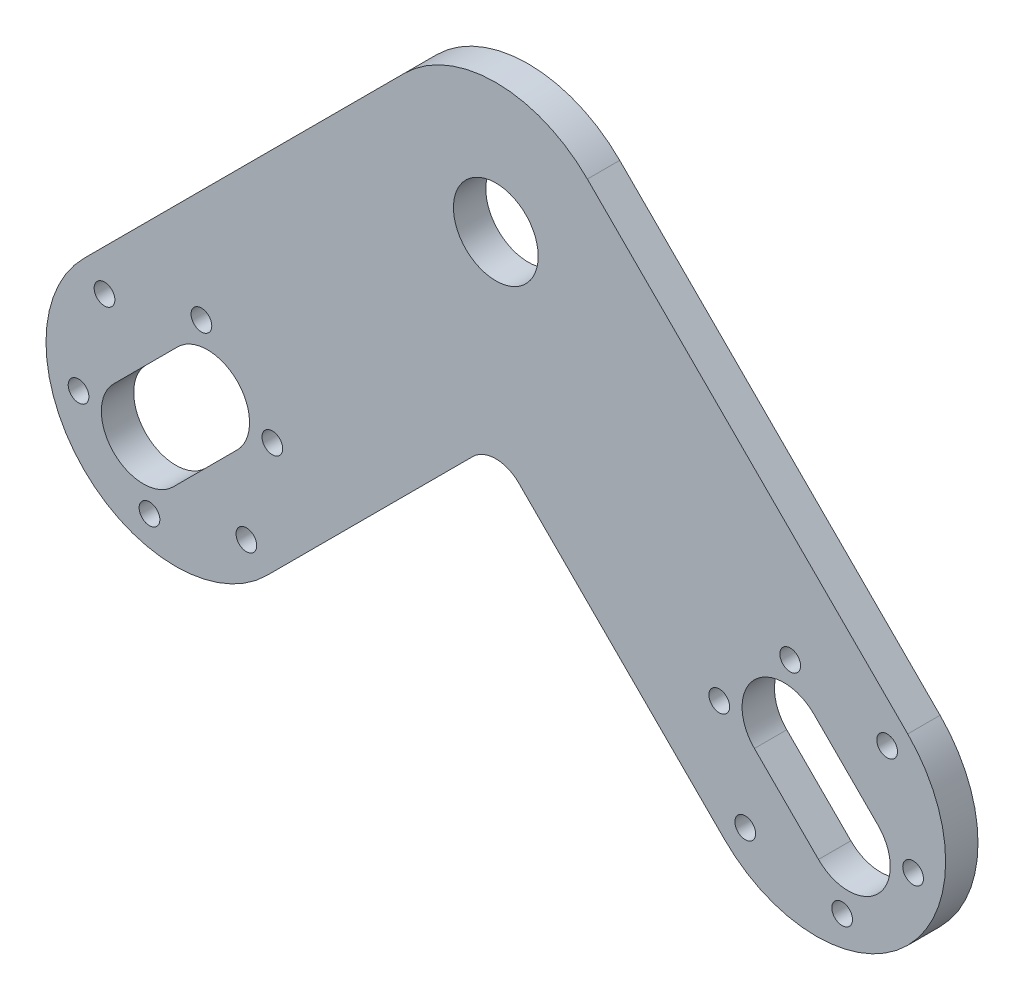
ISO-10303-21;
HEADER;
FILE_DESCRIPTION(('STEP AP214'),'2;1');
FILE_NAME('part.step','',(''),(''),'','','');
FILE_SCHEMA(('AUTOMOTIVE_DESIGN { 1 0 10303 214 1 1 1 1 }'));
ENDSEC;
DATA;
#1=APPLICATION_CONTEXT('core data for automotive mechanical design processes');
#2=APPLICATION_PROTOCOL_DEFINITION('international standard','automotive_design',2000,#1);
#3=PRODUCT_CONTEXT('',#1,'mechanical');
#4=PRODUCT('Part','Part','',(#3));
#5=PRODUCT_RELATED_PRODUCT_CATEGORY('part','',(#4));
#6=PRODUCT_DEFINITION_FORMATION('','',#4);
#7=PRODUCT_DEFINITION_CONTEXT('part definition',#1,'design');
#8=PRODUCT_DEFINITION('design','',#6,#7);
#9=PRODUCT_DEFINITION_SHAPE('','',#8);
#10=(LENGTH_UNIT() NAMED_UNIT(*) SI_UNIT(.MILLI.,.METRE.));
#11=(NAMED_UNIT(*) PLANE_ANGLE_UNIT() SI_UNIT($,.RADIAN.));
#12=(NAMED_UNIT(*) SI_UNIT($,.STERADIAN.) SOLID_ANGLE_UNIT());
#13=UNCERTAINTY_MEASURE_WITH_UNIT(LENGTH_MEASURE(1.E-05),#10,'distance_accuracy_value','');
#14=(GEOMETRIC_REPRESENTATION_CONTEXT(3) GLOBAL_UNCERTAINTY_ASSIGNED_CONTEXT((#13)) GLOBAL_UNIT_ASSIGNED_CONTEXT((#10,
#11,#12)) REPRESENTATION_CONTEXT('',''));
#15=CARTESIAN_POINT('',(0.,0.,0.));
#16=DIRECTION('',(0.,0.,1.));
#17=DIRECTION('',(1.,0.,0.));
#18=AXIS2_PLACEMENT_3D('',#15,#16,#17);
#19=CARTESIAN_POINT('',(0.,0.,5.));
#20=DIRECTION('',(0.,0.,1.));
#21=DIRECTION('',(1.,0.,0.));
#22=AXIS2_PLACEMENT_3D('',#19,#20,#21);
#23=PLANE('',#22);
#24=CARTESIAN_POINT('',(49.4974746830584,49.4974746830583,5.));
#25=DIRECTION('',(0.,0.,1.));
#26=DIRECTION('',(1.,0.,0.));
#27=AXIS2_PLACEMENT_3D('',#24,#25,#26);
#28=CIRCLE('',#27,6.55);
#29=CARTESIAN_POINT('',(56.0474746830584,49.4974746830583,5.));
#30=VERTEX_POINT('',#29);
#31=EDGE_CURVE('E574',#30,#30,#28,.T.);
#32=ORIENTED_EDGE('',*,*,#31,.F.);
#33=EDGE_LOOP('',(#32));
#34=FACE_BOUND('',#33,.T.);
#35=DIRECTION('',(-0.707106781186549,-0.707106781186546,0.));
#36=VECTOR('',#35,1.);
#37=CARTESIAN_POINT('',(-4.59619407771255,4.59619407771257,5.));
#38=LINE('',#37,#36);
#39=CARTESIAN_POINT('',(0.353553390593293,9.5459415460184,5.));
#40=VERTEX_POINT('',#39);
#41=CARTESIAN_POINT('',(-9.54594154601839,-0.353553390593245,5.));
#42=VERTEX_POINT('',#41);
#43=EDGE_CURVE('E356',#40,#42,#38,.T.);
#44=ORIENTED_EDGE('',*,*,#43,.F.);
#45=CARTESIAN_POINT('',(4.94974746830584,4.94974746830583,5.));
#46=DIRECTION('',(0.,0.,1.));
#47=DIRECTION('',(1.,0.,0.));
#48=AXIS2_PLACEMENT_3D('',#45,#46,#47);
#49=CIRCLE('',#48,6.5);
#50=CARTESIAN_POINT('',(9.54594154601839,0.353553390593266,5.));
#51=VERTEX_POINT('',#50);
#52=EDGE_CURVE('E351',#51,#40,#49,.T.);
#53=ORIENTED_EDGE('',*,*,#52,.F.);
#54=DIRECTION('',(0.707106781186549,0.707106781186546,0.));
#55=VECTOR('',#54,1.);
#56=CARTESIAN_POINT('',(4.59619407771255,-4.59619407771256,5.));
#57=LINE('',#56,#55);
#58=CARTESIAN_POINT('',(-0.353553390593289,-9.54594154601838,5.));
#59=VERTEX_POINT('',#58);
#60=EDGE_CURVE('E244',#59,#51,#57,.T.);
#61=ORIENTED_EDGE('',*,*,#60,.F.);
#62=CARTESIAN_POINT('',(-4.94974746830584,-4.94974746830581,5.));
#63=DIRECTION('',(0.,0.,1.));
#64=DIRECTION('',(1.,0.,0.));
#65=AXIS2_PLACEMENT_3D('',#62,#63,#64);
#66=CIRCLE('',#65,6.5);
#67=EDGE_CURVE('E358',#42,#59,#66,.T.);
#68=ORIENTED_EDGE('',*,*,#67,.F.);
#69=EDGE_LOOP('',(#44,#53,#61,#68));
#70=FACE_BOUND('',#69,.T.);
#71=CARTESIAN_POINT('',(14.9718503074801,4.01169519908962,5.));
#72=DIRECTION('',(0.,0.,1.));
#73=DIRECTION('',(1.,0.,0.));
#74=AXIS2_PLACEMENT_3D('',#71,#72,#73);
#75=CIRCLE('',#74,1.6);
#76=CARTESIAN_POINT('',(16.5718503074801,4.01169519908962,5.));
#77=VERTEX_POINT('',#76);
#78=EDGE_CURVE('E346',#77,#77,#75,.T.);
#79=ORIENTED_EDGE('',*,*,#78,.F.);
#80=EDGE_LOOP('',(#79));
#81=FACE_BOUND('',#80,.T.);
#82=CARTESIAN_POINT('',(88.0347942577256,-10.9601551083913,5.));
#83=DIRECTION('',(0.,0.,1.));
#84=DIRECTION('',(1.,0.,0.));
#85=AXIS2_PLACEMENT_3D('',#82,#83,#84);
#86=CIRCLE('',#85,1.6);
#87=CARTESIAN_POINT('',(89.6347942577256,-10.9601551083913,5.));
#88=VERTEX_POINT('',#87);
#89=EDGE_CURVE('E345',#88,#88,#86,.F.);
#90=ORIENTED_EDGE('',*,*,#89,.T.);
#91=EDGE_LOOP('',(#90));
#92=FACE_BOUND('',#91,.T.);
#93=CARTESIAN_POINT('',(113.966799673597,-4.01169519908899,5.));
#94=DIRECTION('',(0.,0.,1.));
#95=DIRECTION('',(1.,0.,0.));
#96=AXIS2_PLACEMENT_3D('',#93,#94,#95);
#97=CIRCLE('',#96,1.6);
#98=CARTESIAN_POINT('',(115.566799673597,-4.01169519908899,5.));
#99=VERTEX_POINT('',#98);
#100=EDGE_CURVE('E336',#99,#99,#97,.F.);
#101=ORIENTED_EDGE('',*,*,#100,.T.);
#102=EDGE_LOOP('',(#101));
#103=FACE_BOUND('',#102,.T.);
#104=CARTESIAN_POINT('',(94.9832541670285,14.9718503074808,5.));
#105=DIRECTION('',(0.,0.,1.));
#106=DIRECTION('',(1.,0.,0.));
#107=AXIS2_PLACEMENT_3D('',#104,#105,#106);
#108=CIRCLE('',#107,1.6);
#109=CARTESIAN_POINT('',(96.5832541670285,14.9718503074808,5.));
#110=VERTEX_POINT('',#109);
#111=EDGE_CURVE('E334',#110,#110,#108,.F.);
#112=ORIENTED_EDGE('',*,*,#111,.T.);
#113=EDGE_LOOP('',(#112));
#114=FACE_BOUND('',#113,.T.);
#115=CARTESIAN_POINT('',(4.01169519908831,14.9718503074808,5.));
#116=DIRECTION('',(0.,0.,1.));
#117=DIRECTION('',(1.,0.,0.));
#118=AXIS2_PLACEMENT_3D('',#115,#116,#117);
#119=CIRCLE('',#118,1.6);
#120=CARTESIAN_POINT('',(5.61169519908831,14.9718503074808,5.));
#121=VERTEX_POINT('',#120);
#122=EDGE_CURVE('E329',#121,#121,#119,.T.);
#123=ORIENTED_EDGE('',*,*,#122,.F.);
#124=EDGE_LOOP('',(#123));
#125=FACE_BOUND('',#124,.T.);
#126=CARTESIAN_POINT('',(-10.9601551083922,10.9601551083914,5.));
#127=DIRECTION('',(0.,0.,1.));
#128=DIRECTION('',(1.,0.,0.));
#129=AXIS2_PLACEMENT_3D('',#126,#127,#128);
#130=CIRCLE('',#129,1.6);
#131=CARTESIAN_POINT('',(-9.36015510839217,10.9601551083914,5.));
#132=VERTEX_POINT('',#131);
#133=EDGE_CURVE('E327',#132,#132,#130,.T.);
#134=ORIENTED_EDGE('',*,*,#133,.F.);
#135=EDGE_LOOP('',(#134));
#136=FACE_BOUND('',#135,.T.);
#137=CARTESIAN_POINT('',(-14.9718503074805,-4.01169519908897,5.));
#138=DIRECTION('',(0.,0.,1.));
#139=DIRECTION('',(1.,0.,0.));
#140=AXIS2_PLACEMENT_3D('',#137,#138,#139);
#141=CIRCLE('',#140,1.6);
#142=CARTESIAN_POINT('',(-13.3718503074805,-4.01169519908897,5.));
#143=VERTEX_POINT('',#142);
#144=EDGE_CURVE('E322',#143,#143,#141,.T.);
#145=ORIENTED_EDGE('',*,*,#144,.F.);
#146=EDGE_LOOP('',(#145));
#147=FACE_BOUND('',#146,.T.);
#148=CARTESIAN_POINT('',(-4.01169519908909,-14.9718503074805,5.));
#149=DIRECTION('',(0.,0.,1.));
#150=DIRECTION('',(1.,0.,0.));
#151=AXIS2_PLACEMENT_3D('',#148,#149,#150);
#152=CIRCLE('',#151,1.6);
#153=CARTESIAN_POINT('',(-2.4116951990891,-14.9718503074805,5.));
#154=VERTEX_POINT('',#153);
#155=EDGE_CURVE('E318',#154,#154,#152,.T.);
#156=ORIENTED_EDGE('',*,*,#155,.F.);
#157=EDGE_LOOP('',(#156));
#158=FACE_BOUND('',#157,.T.);
#159=CARTESIAN_POINT('',(10.9601551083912,-10.9601551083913,5.));
#160=DIRECTION('',(0.,0.,1.));
#161=DIRECTION('',(1.,0.,0.));
#162=AXIS2_PLACEMENT_3D('',#159,#160,#161);
#163=CIRCLE('',#162,1.59999999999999);
#164=CARTESIAN_POINT('',(12.5601551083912,-10.9601551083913,5.));
#165=VERTEX_POINT('',#164);
#166=EDGE_CURVE('E320',#165,#165,#163,.T.);
#167=ORIENTED_EDGE('',*,*,#166,.F.);
#168=EDGE_LOOP('',(#167));
#169=FACE_BOUND('',#168,.T.);
#170=DIRECTION('',(-0.707106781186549,0.707106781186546,0.));
#171=VECTOR('',#170,1.);
#172=CARTESIAN_POINT('',(63.6396103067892,63.6396103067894,5.));
#173=LINE('',#172,#171);
#174=CARTESIAN_POINT('',(113.137084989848,14.142135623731,5.));
#175=VERTEX_POINT('',#174);
#176=CARTESIAN_POINT('',(63.6396103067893,63.6396103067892,5.));
#177=VERTEX_POINT('',#176);
#178=EDGE_CURVE('E363',#175,#177,#173,.T.);
#179=ORIENTED_EDGE('',*,*,#178,.T.);
#180=CARTESIAN_POINT('',(49.4974746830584,49.4974746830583,5.));
#181=DIRECTION('',(0.,0.,1.));
#182=DIRECTION('',(1.,0.,0.));
#183=AXIS2_PLACEMENT_3D('',#180,#181,#182);
#184=CIRCLE('',#183,20.);
#185=CARTESIAN_POINT('',(35.3553390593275,63.6396103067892,5.));
#186=VERTEX_POINT('',#185);
#187=EDGE_CURVE('E364',#177,#186,#184,.T.);
#188=ORIENTED_EDGE('',*,*,#187,.T.);
#189=DIRECTION('',(0.707106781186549,0.707106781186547,0.));
#190=VECTOR('',#189,1.);
#191=CARTESIAN_POINT('',(-14.1421356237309,14.142135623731,5.));
#192=LINE('',#191,#190);
#193=CARTESIAN_POINT('',(-14.1421356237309,14.142135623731,5.));
#194=VERTEX_POINT('',#193);
#195=EDGE_CURVE('E370',#194,#186,#192,.T.);
#196=ORIENTED_EDGE('',*,*,#195,.F.);
#197=CARTESIAN_POINT('',(0.,0.,5.));
#198=DIRECTION('',(0.,0.,1.));
#199=DIRECTION('',(1.,0.,0.));
#200=AXIS2_PLACEMENT_3D('',#197,#198,#199);
#201=CIRCLE('',#200,20.);
#202=CARTESIAN_POINT('',(14.1421356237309,-14.142135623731,5.));
#203=VERTEX_POINT('',#202);
#204=EDGE_CURVE('E369',#194,#203,#201,.T.);
#205=ORIENTED_EDGE('',*,*,#204,.T.);
#206=DIRECTION('',(0.707106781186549,0.707106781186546,0.));
#207=VECTOR('',#206,1.);
#208=CARTESIAN_POINT('',(14.1421356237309,-14.142135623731,5.));
#209=LINE('',#208,#207);
#210=CARTESIAN_POINT('',(45.9619407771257,17.6776695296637,5.));
#211=VERTEX_POINT('',#210);
#212=EDGE_CURVE('E375',#203,#211,#209,.T.);
#213=ORIENTED_EDGE('',*,*,#212,.T.);
#214=CARTESIAN_POINT('',(49.4974746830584,14.1421356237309,5.));
#215=DIRECTION('',(0.,0.,1.));
#216=DIRECTION('',(1.,0.,0.));
#217=AXIS2_PLACEMENT_3D('',#214,#215,#216);
#218=CIRCLE('',#217,5.);
#219=CARTESIAN_POINT('',(53.0330085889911,17.6776695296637,5.));
#220=VERTEX_POINT('',#219);
#221=EDGE_CURVE('E12',#211,#220,#218,.F.);
#222=ORIENTED_EDGE('',*,*,#221,.T.);
#223=DIRECTION('',(-0.707106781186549,0.707106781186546,0.));
#224=VECTOR('',#223,1.);
#225=CARTESIAN_POINT('',(35.3553390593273,35.3553390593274,5.));
#226=LINE('',#225,#224);
#227=CARTESIAN_POINT('',(84.8528137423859,-14.142135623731,5.));
#228=VERTEX_POINT('',#227);
#229=EDGE_CURVE('E374',#228,#220,#226,.T.);
#230=ORIENTED_EDGE('',*,*,#229,.F.);
#231=CARTESIAN_POINT('',(98.9949493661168,0.,5.));
#232=DIRECTION('',(0.,0.,-1.));
#233=DIRECTION('',(-1.,0.,0.));
#234=AXIS2_PLACEMENT_3D('',#231,#232,#233);
#235=CIRCLE('',#234,20.);
#236=EDGE_CURVE('E384',#175,#228,#235,.T.);
#237=ORIENTED_EDGE('',*,*,#236,.F.);
#238=EDGE_LOOP('',(#179,#188,#196,#205,#213,#222,#230,#237));
#239=FACE_BOUND('',#238,.T.);
#240=DIRECTION('',(0.707106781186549,-0.707106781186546,0.));
#241=VECTOR('',#240,1.);
#242=CARTESIAN_POINT('',(54.0936687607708,54.093668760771,5.));
#243=LINE('',#242,#241);
#244=CARTESIAN_POINT('',(98.6413959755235,9.54594154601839,5.));
#245=VERTEX_POINT('',#244);
#246=CARTESIAN_POINT('',(108.540890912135,-0.353553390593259,5.));
#247=VERTEX_POINT('',#246);
#248=EDGE_CURVE('E311',#245,#247,#243,.T.);
#249=ORIENTED_EDGE('',*,*,#248,.T.);
#250=CARTESIAN_POINT('',(103.944696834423,-4.94974746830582,5.));
#251=DIRECTION('',(0.,0.,1.));
#252=DIRECTION('',(1.,0.,0.));
#253=AXIS2_PLACEMENT_3D('',#250,#251,#252);
#254=CIRCLE('',#253,6.50000000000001);
#255=CARTESIAN_POINT('',(99.3485027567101,-9.54594154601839,5.));
#256=VERTEX_POINT('',#255);
#257=EDGE_CURVE('E313',#247,#256,#254,.F.);
#258=ORIENTED_EDGE('',*,*,#257,.T.);
#259=DIRECTION('',(-0.707106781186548,0.707106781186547,0.));
#260=VECTOR('',#259,1.);
#261=CARTESIAN_POINT('',(44.9012806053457,44.9012806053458,5.));
#262=LINE('',#261,#260);
#263=CARTESIAN_POINT('',(89.4490078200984,0.353553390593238,5.));
#264=VERTEX_POINT('',#263);
#265=EDGE_CURVE('E297',#256,#264,#262,.T.);
#266=ORIENTED_EDGE('',*,*,#265,.T.);
#267=CARTESIAN_POINT('',(94.045201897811,4.94974746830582,5.));
#268=DIRECTION('',(0.,0.,1.));
#269=DIRECTION('',(1.,0.,0.));
#270=AXIS2_PLACEMENT_3D('',#267,#268,#269);
#271=CIRCLE('',#270,6.5);
#272=EDGE_CURVE('E308',#264,#245,#271,.F.);
#273=ORIENTED_EDGE('',*,*,#272,.T.);
#274=EDGE_LOOP('',(#249,#258,#266,#273));
#275=FACE_BOUND('',#274,.T.);
#276=CARTESIAN_POINT('',(109.955104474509,10.9601551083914,5.));
#277=DIRECTION('',(0.,0.,1.));
#278=DIRECTION('',(1.,0.,0.));
#279=AXIS2_PLACEMENT_3D('',#276,#277,#278);
#280=CIRCLE('',#279,1.6);
#281=CARTESIAN_POINT('',(111.555104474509,10.9601551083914,5.));
#282=VERTEX_POINT('',#281);
#283=EDGE_CURVE('E333',#282,#282,#280,.F.);
#284=ORIENTED_EDGE('',*,*,#283,.T.);
#285=EDGE_LOOP('',(#284));
#286=FACE_BOUND('',#285,.T.);
#287=CARTESIAN_POINT('',(84.0230990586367,4.01169519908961,5.));
#288=DIRECTION('',(0.,0.,1.));
#289=DIRECTION('',(1.,0.,0.));
#290=AXIS2_PLACEMENT_3D('',#287,#288,#289);
#291=CIRCLE('',#290,1.6);
#292=CARTESIAN_POINT('',(85.6230990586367,4.01169519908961,5.));
#293=VERTEX_POINT('',#292);
#294=EDGE_CURVE('E343',#293,#293,#291,.F.);
#295=ORIENTED_EDGE('',*,*,#294,.T.);
#296=EDGE_LOOP('',(#295));
#297=FACE_BOUND('',#296,.T.);
#298=CARTESIAN_POINT('',(103.006644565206,-14.9718503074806,5.));
#299=DIRECTION('',(0.,0.,1.));
#300=DIRECTION('',(1.,0.,0.));
#301=AXIS2_PLACEMENT_3D('',#298,#299,#300);
#302=CIRCLE('',#301,1.6);
#303=CARTESIAN_POINT('',(104.606644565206,-14.9718503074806,5.));
#304=VERTEX_POINT('',#303);
#305=EDGE_CURVE('E350',#304,#304,#302,.F.);
#306=ORIENTED_EDGE('',*,*,#305,.T.);
#307=EDGE_LOOP('',(#306));
#308=FACE_BOUND('',#307,.T.);
#309=ADVANCED_FACE('F129',(#34,#70,#81,#92,#103,#114,#125,#136,#147,#158,#169,#239,#275,#286,
#297,#308),#23,.T.);
#310=CARTESIAN_POINT('',(0.,0.,0.));
#311=DIRECTION('',(0.,0.,1.));
#312=DIRECTION('',(1.,0.,0.));
#313=AXIS2_PLACEMENT_3D('',#310,#311,#312);
#314=PLANE('',#313);
#315=CARTESIAN_POINT('',(49.4974746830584,49.4974746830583,0.));
#316=DIRECTION('',(0.,0.,1.));
#317=DIRECTION('',(1.,0.,0.));
#318=AXIS2_PLACEMENT_3D('',#315,#316,#317);
#319=CIRCLE('',#318,6.55);
#320=CARTESIAN_POINT('',(56.0474746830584,49.4974746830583,0.));
#321=VERTEX_POINT('',#320);
#322=EDGE_CURVE('E132',#321,#321,#319,.T.);
#323=ORIENTED_EDGE('',*,*,#322,.T.);
#324=EDGE_LOOP('',(#323));
#325=FACE_BOUND('',#324,.T.);
#326=CARTESIAN_POINT('',(4.94974746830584,4.94974746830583,0.));
#327=DIRECTION('',(0.,0.,-1.));
#328=DIRECTION('',(-1.,0.,0.));
#329=AXIS2_PLACEMENT_3D('',#326,#327,#328);
#330=CIRCLE('',#329,6.5);
#331=CARTESIAN_POINT('',(0.353553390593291,9.5459415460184,0.));
#332=VERTEX_POINT('',#331);
#333=CARTESIAN_POINT('',(9.54594154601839,0.353553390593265,0.));
#334=VERTEX_POINT('',#333);
#335=EDGE_CURVE('E255',#332,#334,#330,.T.);
#336=ORIENTED_EDGE('',*,*,#335,.F.);
#337=DIRECTION('',(0.707106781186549,0.707106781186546,0.));
#338=VECTOR('',#337,1.);
#339=CARTESIAN_POINT('',(-4.59619407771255,4.59619407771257,0.));
#340=LINE('',#339,#338);
#341=CARTESIAN_POINT('',(-9.54594154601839,-0.353553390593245,0.));
#342=VERTEX_POINT('',#341);
#343=EDGE_CURVE('E259',#342,#332,#340,.T.);
#344=ORIENTED_EDGE('',*,*,#343,.F.);
#345=CARTESIAN_POINT('',(-4.94974746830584,-4.94974746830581,0.));
#346=DIRECTION('',(0.,0.,-1.));
#347=DIRECTION('',(-1.,0.,0.));
#348=AXIS2_PLACEMENT_3D('',#345,#346,#347);
#349=CIRCLE('',#348,6.5);
#350=CARTESIAN_POINT('',(-0.353553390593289,-9.54594154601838,0.));
#351=VERTEX_POINT('',#350);
#352=EDGE_CURVE('E265',#351,#342,#349,.T.);
#353=ORIENTED_EDGE('',*,*,#352,.F.);
#354=DIRECTION('',(-0.707106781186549,-0.707106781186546,0.));
#355=VECTOR('',#354,1.);
#356=CARTESIAN_POINT('',(4.59619407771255,-4.59619407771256,0.));
#357=LINE('',#356,#355);
#358=EDGE_CURVE('E245',#334,#351,#357,.T.);
#359=ORIENTED_EDGE('',*,*,#358,.F.);
#360=EDGE_LOOP('',(#336,#344,#353,#359));
#361=FACE_BOUND('',#360,.T.);
#362=CARTESIAN_POINT('',(14.9718503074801,4.01169519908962,0.));
#363=DIRECTION('',(0.,0.,-1.));
#364=DIRECTION('',(-1.,0.,0.));
#365=AXIS2_PLACEMENT_3D('',#362,#363,#364);
#366=CIRCLE('',#365,1.6);
#367=CARTESIAN_POINT('',(13.3718503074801,4.01169519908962,0.));
#368=VERTEX_POINT('',#367);
#369=EDGE_CURVE('E266',#368,#368,#366,.T.);
#370=ORIENTED_EDGE('',*,*,#369,.F.);
#371=EDGE_LOOP('',(#370));
#372=FACE_BOUND('',#371,.T.);
#373=CARTESIAN_POINT('',(4.01169519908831,14.9718503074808,0.));
#374=DIRECTION('',(0.,0.,-1.));
#375=DIRECTION('',(-1.,0.,0.));
#376=AXIS2_PLACEMENT_3D('',#373,#374,#375);
#377=CIRCLE('',#376,1.6);
#378=CARTESIAN_POINT('',(2.41169519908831,14.9718503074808,0.));
#379=VERTEX_POINT('',#378);
#380=EDGE_CURVE('E585',#379,#379,#377,.T.);
#381=ORIENTED_EDGE('',*,*,#380,.F.);
#382=EDGE_LOOP('',(#381));
#383=FACE_BOUND('',#382,.T.);
#384=CARTESIAN_POINT('',(-10.9601551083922,10.9601551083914,0.));
#385=DIRECTION('',(0.,0.,-1.));
#386=DIRECTION('',(-1.,0.,0.));
#387=AXIS2_PLACEMENT_3D('',#384,#385,#386);
#388=CIRCLE('',#387,1.6);
#389=CARTESIAN_POINT('',(-12.5601551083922,10.9601551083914,0.));
#390=VERTEX_POINT('',#389);
#391=EDGE_CURVE('E590',#390,#390,#388,.T.);
#392=ORIENTED_EDGE('',*,*,#391,.F.);
#393=EDGE_LOOP('',(#392));
#394=FACE_BOUND('',#393,.T.);
#395=CARTESIAN_POINT('',(-14.9718503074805,-4.01169519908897,0.));
#396=DIRECTION('',(0.,0.,-1.));
#397=DIRECTION('',(-1.,0.,0.));
#398=AXIS2_PLACEMENT_3D('',#395,#396,#397);
#399=CIRCLE('',#398,1.6);
#400=CARTESIAN_POINT('',(-16.5718503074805,-4.01169519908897,0.));
#401=VERTEX_POINT('',#400);
#402=EDGE_CURVE('E586',#401,#401,#399,.T.);
#403=ORIENTED_EDGE('',*,*,#402,.F.);
#404=EDGE_LOOP('',(#403));
#405=FACE_BOUND('',#404,.T.);
#406=CARTESIAN_POINT('',(-4.01169519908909,-14.9718503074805,0.));
#407=DIRECTION('',(0.,0.,-1.));
#408=DIRECTION('',(-1.,0.,0.));
#409=AXIS2_PLACEMENT_3D('',#406,#407,#408);
#410=CIRCLE('',#409,1.6);
#411=CARTESIAN_POINT('',(-5.61169519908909,-14.9718503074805,0.));
#412=VERTEX_POINT('',#411);
#413=EDGE_CURVE('E578',#412,#412,#410,.T.);
#414=ORIENTED_EDGE('',*,*,#413,.F.);
#415=EDGE_LOOP('',(#414));
#416=FACE_BOUND('',#415,.T.);
#417=CARTESIAN_POINT('',(10.9601551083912,-10.9601551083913,0.));
#418=DIRECTION('',(0.,0.,-1.));
#419=DIRECTION('',(-1.,0.,0.));
#420=AXIS2_PLACEMENT_3D('',#417,#418,#419);
#421=CIRCLE('',#420,1.59999999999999);
#422=CARTESIAN_POINT('',(9.36015510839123,-10.9601551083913,0.));
#423=VERTEX_POINT('',#422);
#424=EDGE_CURVE('E579',#423,#423,#421,.T.);
#425=ORIENTED_EDGE('',*,*,#424,.F.);
#426=EDGE_LOOP('',(#425));
#427=FACE_BOUND('',#426,.T.);
#428=DIRECTION('',(-0.707106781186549,0.707106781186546,0.));
#429=VECTOR('',#428,1.);
#430=CARTESIAN_POINT('',(63.6396103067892,63.6396103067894,0.));
#431=LINE('',#430,#429);
#432=CARTESIAN_POINT('',(113.137084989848,14.142135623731,0.));
#433=VERTEX_POINT('',#432);
#434=CARTESIAN_POINT('',(63.6396103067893,63.6396103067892,0.));
#435=VERTEX_POINT('',#434);
#436=EDGE_CURVE('E378',#433,#435,#431,.T.);
#437=ORIENTED_EDGE('',*,*,#436,.F.);
#438=CARTESIAN_POINT('',(98.9949493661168,0.,0.));
#439=DIRECTION('',(0.,0.,-1.));
#440=DIRECTION('',(-1.,0.,0.));
#441=AXIS2_PLACEMENT_3D('',#438,#439,#440);
#442=CIRCLE('',#441,20.);
#443=CARTESIAN_POINT('',(84.8528137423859,-14.142135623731,0.));
#444=VERTEX_POINT('',#443);
#445=EDGE_CURVE('E359',#433,#444,#442,.T.);
#446=ORIENTED_EDGE('',*,*,#445,.T.);
#447=DIRECTION('',(-0.707106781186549,0.707106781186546,0.));
#448=VECTOR('',#447,1.);
#449=CARTESIAN_POINT('',(35.3553390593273,35.3553390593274,0.));
#450=LINE('',#449,#448);
#451=CARTESIAN_POINT('',(53.0330085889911,17.6776695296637,0.));
#452=VERTEX_POINT('',#451);
#453=EDGE_CURVE('E362',#444,#452,#450,.T.);
#454=ORIENTED_EDGE('',*,*,#453,.T.);
#455=CARTESIAN_POINT('',(49.4974746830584,14.1421356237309,0.));
#456=DIRECTION('',(0.,0.,1.));
#457=DIRECTION('',(1.,0.,0.));
#458=AXIS2_PLACEMENT_3D('',#455,#456,#457);
#459=CIRCLE('',#458,5.);
#460=CARTESIAN_POINT('',(45.9619407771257,17.6776695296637,0.));
#461=VERTEX_POINT('',#460);
#462=EDGE_CURVE('E137',#452,#461,#459,.T.);
#463=ORIENTED_EDGE('',*,*,#462,.T.);
#464=DIRECTION('',(0.707106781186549,0.707106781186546,0.));
#465=VECTOR('',#464,1.);
#466=CARTESIAN_POINT('',(14.1421356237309,-14.142135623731,0.));
#467=LINE('',#466,#465);
#468=CARTESIAN_POINT('',(14.1421356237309,-14.142135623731,0.));
#469=VERTEX_POINT('',#468);
#470=EDGE_CURVE('E392',#469,#461,#467,.T.);
#471=ORIENTED_EDGE('',*,*,#470,.F.);
#472=CARTESIAN_POINT('',(0.,0.,0.));
#473=DIRECTION('',(0.,0.,1.));
#474=DIRECTION('',(1.,0.,0.));
#475=AXIS2_PLACEMENT_3D('',#472,#473,#474);
#476=CIRCLE('',#475,20.);
#477=CARTESIAN_POINT('',(-14.1421356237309,14.142135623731,0.));
#478=VERTEX_POINT('',#477);
#479=EDGE_CURVE('E390',#478,#469,#476,.T.);
#480=ORIENTED_EDGE('',*,*,#479,.F.);
#481=DIRECTION('',(0.707106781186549,0.707106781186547,0.));
#482=VECTOR('',#481,1.);
#483=CARTESIAN_POINT('',(-14.1421356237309,14.142135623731,0.));
#484=LINE('',#483,#482);
#485=CARTESIAN_POINT('',(35.3553390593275,63.6396103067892,0.));
#486=VERTEX_POINT('',#485);
#487=EDGE_CURVE('E388',#478,#486,#484,.T.);
#488=ORIENTED_EDGE('',*,*,#487,.T.);
#489=CARTESIAN_POINT('',(49.4974746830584,49.4974746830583,0.));
#490=DIRECTION('',(0.,0.,1.));
#491=DIRECTION('',(1.,0.,0.));
#492=AXIS2_PLACEMENT_3D('',#489,#490,#491);
#493=CIRCLE('',#492,20.);
#494=EDGE_CURVE('E385',#435,#486,#493,.T.);
#495=ORIENTED_EDGE('',*,*,#494,.F.);
#496=EDGE_LOOP('',(#437,#446,#454,#463,#471,#480,#488,#495));
#497=FACE_BOUND('',#496,.T.);
#498=CARTESIAN_POINT('',(103.944696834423,-4.94974746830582,0.));
#499=DIRECTION('',(0.,0.,-1.));
#500=DIRECTION('',(-1.,0.,0.));
#501=AXIS2_PLACEMENT_3D('',#498,#499,#500);
#502=CIRCLE('',#501,6.50000000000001);
#503=CARTESIAN_POINT('',(99.3485027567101,-9.54594154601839,0.));
#504=VERTEX_POINT('',#503);
#505=CARTESIAN_POINT('',(108.540890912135,-0.353553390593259,0.));
#506=VERTEX_POINT('',#505);
#507=EDGE_CURVE('E273',#504,#506,#502,.F.);
#508=ORIENTED_EDGE('',*,*,#507,.T.);
#509=DIRECTION('',(-0.707106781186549,0.707106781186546,0.));
#510=VECTOR('',#509,1.);
#511=CARTESIAN_POINT('',(54.0936687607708,54.093668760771,0.));
#512=LINE('',#511,#510);
#513=CARTESIAN_POINT('',(98.6413959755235,9.54594154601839,0.));
#514=VERTEX_POINT('',#513);
#515=EDGE_CURVE('E295',#506,#514,#512,.T.);
#516=ORIENTED_EDGE('',*,*,#515,.T.);
#517=CARTESIAN_POINT('',(94.045201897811,4.94974746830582,0.));
#518=DIRECTION('',(0.,0.,-1.));
#519=DIRECTION('',(-1.,0.,0.));
#520=AXIS2_PLACEMENT_3D('',#517,#518,#519);
#521=CIRCLE('',#520,6.5);
#522=CARTESIAN_POINT('',(89.4490078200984,0.353553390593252,0.));
#523=VERTEX_POINT('',#522);
#524=EDGE_CURVE('E293',#514,#523,#521,.F.);
#525=ORIENTED_EDGE('',*,*,#524,.T.);
#526=DIRECTION('',(0.707106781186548,-0.707106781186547,0.));
#527=VECTOR('',#526,1.);
#528=CARTESIAN_POINT('',(44.9012806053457,44.9012806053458,0.));
#529=LINE('',#528,#527);
#530=EDGE_CURVE('E286',#523,#504,#529,.T.);
#531=ORIENTED_EDGE('',*,*,#530,.T.);
#532=EDGE_LOOP('',(#508,#516,#525,#531));
#533=FACE_BOUND('',#532,.T.);
#534=CARTESIAN_POINT('',(94.9832541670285,14.9718503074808,0.));
#535=DIRECTION('',(0.,0.,-1.));
#536=DIRECTION('',(-1.,0.,0.));
#537=AXIS2_PLACEMENT_3D('',#534,#535,#536);
#538=CIRCLE('',#537,1.6);
#539=CARTESIAN_POINT('',(93.3832541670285,14.9718503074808,0.));
#540=VERTEX_POINT('',#539);
#541=EDGE_CURVE('E275',#540,#540,#538,.F.);
#542=ORIENTED_EDGE('',*,*,#541,.T.);
#543=EDGE_LOOP('',(#542));
#544=FACE_BOUND('',#543,.T.);
#545=CARTESIAN_POINT('',(109.955104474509,10.9601551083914,0.));
#546=DIRECTION('',(0.,0.,-1.));
#547=DIRECTION('',(-1.,0.,0.));
#548=AXIS2_PLACEMENT_3D('',#545,#546,#547);
#549=CIRCLE('',#548,1.6);
#550=CARTESIAN_POINT('',(108.355104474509,10.9601551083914,0.));
#551=VERTEX_POINT('',#550);
#552=EDGE_CURVE('E278',#551,#551,#549,.F.);
#553=ORIENTED_EDGE('',*,*,#552,.T.);
#554=EDGE_LOOP('',(#553));
#555=FACE_BOUND('',#554,.T.);
#556=CARTESIAN_POINT('',(113.966799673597,-4.01169519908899,0.));
#557=DIRECTION('',(0.,0.,-1.));
#558=DIRECTION('',(-1.,0.,0.));
#559=AXIS2_PLACEMENT_3D('',#556,#557,#558);
#560=CIRCLE('',#559,1.6);
#561=CARTESIAN_POINT('',(112.366799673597,-4.01169519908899,0.));
#562=VERTEX_POINT('',#561);
#563=EDGE_CURVE('E280',#562,#562,#560,.F.);
#564=ORIENTED_EDGE('',*,*,#563,.T.);
#565=EDGE_LOOP('',(#564));
#566=FACE_BOUND('',#565,.T.);
#567=CARTESIAN_POINT('',(84.0230990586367,4.01169519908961,0.));
#568=DIRECTION('',(0.,0.,-1.));
#569=DIRECTION('',(-1.,0.,0.));
#570=AXIS2_PLACEMENT_3D('',#567,#568,#569);
#571=CIRCLE('',#570,1.6);
#572=CARTESIAN_POINT('',(82.4230990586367,4.01169519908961,0.));
#573=VERTEX_POINT('',#572);
#574=EDGE_CURVE('E285',#573,#573,#571,.F.);
#575=ORIENTED_EDGE('',*,*,#574,.T.);
#576=EDGE_LOOP('',(#575));
#577=FACE_BOUND('',#576,.T.);
#578=CARTESIAN_POINT('',(88.0347942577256,-10.9601551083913,0.));
#579=DIRECTION('',(0.,0.,-1.));
#580=DIRECTION('',(-1.,0.,0.));
#581=AXIS2_PLACEMENT_3D('',#578,#579,#580);
#582=CIRCLE('',#581,1.6);
#583=CARTESIAN_POINT('',(86.4347942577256,-10.9601551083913,0.));
#584=VERTEX_POINT('',#583);
#585=EDGE_CURVE('E281',#584,#584,#582,.F.);
#586=ORIENTED_EDGE('',*,*,#585,.T.);
#587=EDGE_LOOP('',(#586));
#588=FACE_BOUND('',#587,.T.);
#589=CARTESIAN_POINT('',(103.006644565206,-14.9718503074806,0.));
#590=DIRECTION('',(0.,0.,-1.));
#591=DIRECTION('',(-1.,0.,0.));
#592=AXIS2_PLACEMENT_3D('',#589,#590,#591);
#593=CIRCLE('',#592,1.6);
#594=CARTESIAN_POINT('',(101.406644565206,-14.9718503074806,0.));
#595=VERTEX_POINT('',#594);
#596=EDGE_CURVE('E600',#595,#595,#593,.F.);
#597=ORIENTED_EDGE('',*,*,#596,.T.);
#598=EDGE_LOOP('',(#597));
#599=FACE_BOUND('',#598,.T.);
#600=ADVANCED_FACE('F260',(#325,#361,#372,#383,#394,#405,#416,#427,#497,#533,#544,#555,#566,
#577,#588,#599),#314,.F.);
#601=CARTESIAN_POINT('',(63.6396103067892,63.6396103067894,5.));
#602=DIRECTION('',(-0.707106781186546,-0.707106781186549,0.));
#603=DIRECTION('',(0.707106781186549,-0.707106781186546,0.));
#604=AXIS2_PLACEMENT_3D('',#601,#602,#603);
#605=PLANE('',#604);
#606=ORIENTED_EDGE('',*,*,#436,.T.);
#607=DIRECTION('',(0.,0.,-1.));
#608=VECTOR('',#607,1.);
#609=CARTESIAN_POINT('',(63.6396103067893,63.6396103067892,5.));
#610=LINE('',#609,#608);
#611=EDGE_CURVE('E408',#177,#435,#610,.T.);
#612=ORIENTED_EDGE('',*,*,#611,.F.);
#613=ORIENTED_EDGE('',*,*,#178,.F.);
#614=DIRECTION('',(0.,0.,-1.));
#615=VECTOR('',#614,1.);
#616=CARTESIAN_POINT('',(113.137084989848,14.142135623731,5.));
#617=LINE('',#616,#615);
#618=EDGE_CURVE('E377',#175,#433,#617,.T.);
#619=ORIENTED_EDGE('',*,*,#618,.T.);
#620=EDGE_LOOP('',(#606,#612,#613,#619));
#621=FACE_BOUND('',#620,.T.);
#622=ADVANCED_FACE('F443',(#621),#605,.F.);
#623=CARTESIAN_POINT('',(49.4974746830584,49.4974746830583,5.));
#624=DIRECTION('',(0.,0.,-1.));
#625=DIRECTION('',(-1.,0.,0.));
#626=AXIS2_PLACEMENT_3D('',#623,#624,#625);
#627=CYLINDRICAL_SURFACE('',#626,20.);
#628=ORIENTED_EDGE('',*,*,#494,.T.);
#629=DIRECTION('',(0.,0.,-1.));
#630=VECTOR('',#629,1.);
#631=CARTESIAN_POINT('',(35.3553390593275,63.6396103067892,5.));
#632=LINE('',#631,#630);
#633=EDGE_CURVE('E404',#186,#486,#632,.T.);
#634=ORIENTED_EDGE('',*,*,#633,.F.);
#635=ORIENTED_EDGE('',*,*,#187,.F.);
#636=ORIENTED_EDGE('',*,*,#611,.T.);
#637=EDGE_LOOP('',(#628,#634,#635,#636));
#638=FACE_BOUND('',#637,.T.);
#639=ADVANCED_FACE('F447',(#638),#627,.T.);
#640=CARTESIAN_POINT('',(-14.1421356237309,14.142135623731,5.));
#641=DIRECTION('',(-0.707106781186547,0.707106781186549,0.));
#642=DIRECTION('',(-0.707106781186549,-0.707106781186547,0.));
#643=AXIS2_PLACEMENT_3D('',#640,#641,#642);
#644=PLANE('',#643);
#645=ORIENTED_EDGE('',*,*,#487,.F.);
#646=DIRECTION('',(0.,0.,-1.));
#647=VECTOR('',#646,1.);
#648=CARTESIAN_POINT('',(-14.1421356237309,14.142135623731,5.));
#649=LINE('',#648,#647);
#650=EDGE_CURVE('E405',#194,#478,#649,.T.);
#651=ORIENTED_EDGE('',*,*,#650,.F.);
#652=ORIENTED_EDGE('',*,*,#195,.T.);
#653=ORIENTED_EDGE('',*,*,#633,.T.);
#654=EDGE_LOOP('',(#645,#651,#652,#653));
#655=FACE_BOUND('',#654,.T.);
#656=ADVANCED_FACE('F454',(#655),#644,.T.);
#657=CARTESIAN_POINT('',(0.,0.,5.));
#658=DIRECTION('',(0.,0.,-1.));
#659=DIRECTION('',(-1.,0.,0.));
#660=AXIS2_PLACEMENT_3D('',#657,#658,#659);
#661=CYLINDRICAL_SURFACE('',#660,20.);
#662=ORIENTED_EDGE('',*,*,#479,.T.);
#663=DIRECTION('',(0.,0.,-1.));
#664=VECTOR('',#663,1.);
#665=CARTESIAN_POINT('',(14.1421356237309,-14.142135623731,5.));
#666=LINE('',#665,#664);
#667=EDGE_CURVE('E396',#203,#469,#666,.T.);
#668=ORIENTED_EDGE('',*,*,#667,.F.);
#669=ORIENTED_EDGE('',*,*,#204,.F.);
#670=ORIENTED_EDGE('',*,*,#650,.T.);
#671=EDGE_LOOP('',(#662,#668,#669,#670));
#672=FACE_BOUND('',#671,.T.);
#673=ADVANCED_FACE('F455',(#672),#661,.T.);
#674=CARTESIAN_POINT('',(14.1421356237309,-14.142135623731,5.));
#675=DIRECTION('',(-0.707106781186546,0.707106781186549,0.));
#676=DIRECTION('',(-0.707106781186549,-0.707106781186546,0.));
#677=AXIS2_PLACEMENT_3D('',#674,#675,#676);
#678=PLANE('',#677);
#679=ORIENTED_EDGE('',*,*,#470,.T.);
#680=DIRECTION('',(0.,0.,-1.));
#681=VECTOR('',#680,1.);
#682=CARTESIAN_POINT('',(45.9619407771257,17.6776695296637,5.));
#683=LINE('',#682,#681);
#684=EDGE_CURVE('E418',#461,#211,#683,.F.);
#685=ORIENTED_EDGE('',*,*,#684,.T.);
#686=ORIENTED_EDGE('',*,*,#212,.F.);
#687=ORIENTED_EDGE('',*,*,#667,.T.);
#688=EDGE_LOOP('',(#679,#685,#686,#687));
#689=FACE_BOUND('',#688,.T.);
#690=ADVANCED_FACE('F426',(#689),#678,.F.);
#691=CARTESIAN_POINT('',(35.3553390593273,35.3553390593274,5.));
#692=DIRECTION('',(-0.707106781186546,-0.707106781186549,0.));
#693=DIRECTION('',(0.707106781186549,-0.707106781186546,0.));
#694=AXIS2_PLACEMENT_3D('',#691,#692,#693);
#695=PLANE('',#694);
#696=ORIENTED_EDGE('',*,*,#229,.T.);
#697=DIRECTION('',(0.,0.,-1.));
#698=VECTOR('',#697,1.);
#699=CARTESIAN_POINT('',(53.0330085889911,17.6776695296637,5.));
#700=LINE('',#699,#698);
#701=EDGE_CURVE('E410',#220,#452,#700,.T.);
#702=ORIENTED_EDGE('',*,*,#701,.T.);
#703=ORIENTED_EDGE('',*,*,#453,.F.);
#704=DIRECTION('',(0.,0.,-1.));
#705=VECTOR('',#704,1.);
#706=CARTESIAN_POINT('',(84.8528137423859,-14.142135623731,5.));
#707=LINE('',#706,#705);
#708=EDGE_CURVE('E399',#228,#444,#707,.T.);
#709=ORIENTED_EDGE('',*,*,#708,.F.);
#710=EDGE_LOOP('',(#696,#702,#703,#709));
#711=FACE_BOUND('',#710,.T.);
#712=ADVANCED_FACE('F440',(#711),#695,.T.);
#713=CARTESIAN_POINT('',(98.9949493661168,0.,5.));
#714=DIRECTION('',(0.,0.,-1.));
#715=DIRECTION('',(-1.,0.,0.));
#716=AXIS2_PLACEMENT_3D('',#713,#714,#715);
#717=CYLINDRICAL_SURFACE('',#716,20.);
#718=ORIENTED_EDGE('',*,*,#618,.F.);
#719=ORIENTED_EDGE('',*,*,#236,.T.);
#720=ORIENTED_EDGE('',*,*,#708,.T.);
#721=ORIENTED_EDGE('',*,*,#445,.F.);
#722=EDGE_LOOP('',(#718,#719,#720,#721));
#723=FACE_BOUND('',#722,.T.);
#724=ADVANCED_FACE('F439',(#723),#717,.T.);
#725=CARTESIAN_POINT('',(49.4974746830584,14.1421356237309,5.));
#726=DIRECTION('',(0.,0.,-1.));
#727=DIRECTION('',(-1.,0.,0.));
#728=AXIS2_PLACEMENT_3D('',#725,#726,#727);
#729=CYLINDRICAL_SURFACE('',#728,5.);
#730=ORIENTED_EDGE('',*,*,#221,.F.);
#731=ORIENTED_EDGE('',*,*,#684,.F.);
#732=ORIENTED_EDGE('',*,*,#462,.F.);
#733=ORIENTED_EDGE('',*,*,#701,.F.);
#734=EDGE_LOOP('',(#730,#731,#732,#733));
#735=FACE_BOUND('',#734,.T.);
#736=ADVANCED_FACE('F130',(#735),#729,.F.);
#737=CARTESIAN_POINT('',(103.944696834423,-4.94974746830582,10.));
#738=DIRECTION('',(0.,0.,-1.));
#739=DIRECTION('',(-1.,0.,0.));
#740=AXIS2_PLACEMENT_3D('',#737,#738,#739);
#741=CYLINDRICAL_SURFACE('',#740,6.50000000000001);
#742=DIRECTION('',(0.,0.,-1.));
#743=VECTOR('',#742,1.);
#744=CARTESIAN_POINT('',(108.540890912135,-0.353553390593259,10.));
#745=LINE('',#744,#743);
#746=EDGE_CURVE('E296',#247,#506,#745,.T.);
#747=ORIENTED_EDGE('',*,*,#746,.T.);
#748=ORIENTED_EDGE('',*,*,#507,.F.);
#749=DIRECTION('',(0.,0.,-1.));
#750=VECTOR('',#749,1.);
#751=CARTESIAN_POINT('',(99.3485027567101,-9.54594154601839,10.));
#752=LINE('',#751,#750);
#753=EDGE_CURVE('E300',#256,#504,#752,.T.);
#754=ORIENTED_EDGE('',*,*,#753,.F.);
#755=ORIENTED_EDGE('',*,*,#257,.F.);
#756=EDGE_LOOP('',(#747,#748,#754,#755));
#757=FACE_BOUND('',#756,.T.);
#758=ADVANCED_FACE('F477',(#757),#741,.F.);
#759=CARTESIAN_POINT('',(54.0936687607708,54.093668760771,10.));
#760=DIRECTION('',(-0.707106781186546,-0.707106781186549,0.));
#761=DIRECTION('',(0.707106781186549,-0.707106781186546,0.));
#762=AXIS2_PLACEMENT_3D('',#759,#760,#761);
#763=PLANE('',#762);
#764=DIRECTION('',(0.,0.,-1.));
#765=VECTOR('',#764,1.);
#766=CARTESIAN_POINT('',(98.6413959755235,9.54594154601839,10.));
#767=LINE('',#766,#765);
#768=EDGE_CURVE('E301',#245,#514,#767,.T.);
#769=ORIENTED_EDGE('',*,*,#768,.T.);
#770=ORIENTED_EDGE('',*,*,#515,.F.);
#771=ORIENTED_EDGE('',*,*,#746,.F.);
#772=ORIENTED_EDGE('',*,*,#248,.F.);
#773=EDGE_LOOP('',(#769,#770,#771,#772));
#774=FACE_BOUND('',#773,.T.);
#775=ADVANCED_FACE('F488',(#774),#763,.T.);
#776=CARTESIAN_POINT('',(94.045201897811,4.94974746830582,10.));
#777=DIRECTION('',(0.,0.,-1.));
#778=DIRECTION('',(-1.,0.,0.));
#779=AXIS2_PLACEMENT_3D('',#776,#777,#778);
#780=CYLINDRICAL_SURFACE('',#779,6.5);
#781=DIRECTION('',(0.,0.,-1.));
#782=VECTOR('',#781,1.);
#783=CARTESIAN_POINT('',(89.4490078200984,0.353553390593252,10.));
#784=LINE('',#783,#782);
#785=EDGE_CURVE('E152',#264,#523,#784,.T.);
#786=ORIENTED_EDGE('',*,*,#785,.T.);
#787=ORIENTED_EDGE('',*,*,#524,.F.);
#788=ORIENTED_EDGE('',*,*,#768,.F.);
#789=ORIENTED_EDGE('',*,*,#272,.F.);
#790=EDGE_LOOP('',(#786,#787,#788,#789));
#791=FACE_BOUND('',#790,.T.);
#792=ADVANCED_FACE('F493',(#791),#780,.F.);
#793=CARTESIAN_POINT('',(44.9012806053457,44.9012806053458,10.));
#794=DIRECTION('',(0.707106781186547,0.707106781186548,0.));
#795=DIRECTION('',(-0.707106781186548,0.707106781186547,0.));
#796=AXIS2_PLACEMENT_3D('',#793,#794,#795);
#797=PLANE('',#796);
#798=ORIENTED_EDGE('',*,*,#753,.T.);
#799=ORIENTED_EDGE('',*,*,#530,.F.);
#800=ORIENTED_EDGE('',*,*,#785,.F.);
#801=ORIENTED_EDGE('',*,*,#265,.F.);
#802=EDGE_LOOP('',(#798,#799,#800,#801));
#803=FACE_BOUND('',#802,.T.);
#804=ADVANCED_FACE('F499',(#803),#797,.T.);
#805=CARTESIAN_POINT('',(10.9601551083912,-10.9601551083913,10.));
#806=DIRECTION('',(0.,0.,-1.));
#807=DIRECTION('',(-1.,0.,0.));
#808=AXIS2_PLACEMENT_3D('',#805,#806,#807);
#809=CYLINDRICAL_SURFACE('',#808,1.59999999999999);
#810=ORIENTED_EDGE('',*,*,#166,.T.);
#811=EDGE_LOOP('',(#810));
#812=FACE_BOUND('',#811,.T.);
#813=ORIENTED_EDGE('',*,*,#424,.T.);
#814=EDGE_LOOP('',(#813));
#815=FACE_BOUND('',#814,.T.);
#816=ADVANCED_FACE('F507',(#812,#815),#809,.F.);
#817=CARTESIAN_POINT('',(-4.01169519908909,-14.9718503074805,10.));
#818=DIRECTION('',(0.,0.,-1.));
#819=DIRECTION('',(-1.,0.,0.));
#820=AXIS2_PLACEMENT_3D('',#817,#818,#819);
#821=CYLINDRICAL_SURFACE('',#820,1.6);
#822=ORIENTED_EDGE('',*,*,#155,.T.);
#823=EDGE_LOOP('',(#822));
#824=FACE_BOUND('',#823,.T.);
#825=ORIENTED_EDGE('',*,*,#413,.T.);
#826=EDGE_LOOP('',(#825));
#827=FACE_BOUND('',#826,.T.);
#828=ADVANCED_FACE('F551',(#824,#827),#821,.F.);
#829=CARTESIAN_POINT('',(-14.9718503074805,-4.01169519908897,10.));
#830=DIRECTION('',(0.,0.,-1.));
#831=DIRECTION('',(-1.,0.,0.));
#832=AXIS2_PLACEMENT_3D('',#829,#830,#831);
#833=CYLINDRICAL_SURFACE('',#832,1.6);
#834=ORIENTED_EDGE('',*,*,#144,.T.);
#835=EDGE_LOOP('',(#834));
#836=FACE_BOUND('',#835,.T.);
#837=ORIENTED_EDGE('',*,*,#402,.T.);
#838=EDGE_LOOP('',(#837));
#839=FACE_BOUND('',#838,.T.);
#840=ADVANCED_FACE('F560',(#836,#839),#833,.F.);
#841=CARTESIAN_POINT('',(-10.9601551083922,10.9601551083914,10.));
#842=DIRECTION('',(0.,0.,-1.));
#843=DIRECTION('',(-1.,0.,0.));
#844=AXIS2_PLACEMENT_3D('',#841,#842,#843);
#845=CYLINDRICAL_SURFACE('',#844,1.6);
#846=ORIENTED_EDGE('',*,*,#133,.T.);
#847=EDGE_LOOP('',(#846));
#848=FACE_BOUND('',#847,.T.);
#849=ORIENTED_EDGE('',*,*,#391,.T.);
#850=EDGE_LOOP('',(#849));
#851=FACE_BOUND('',#850,.T.);
#852=ADVANCED_FACE('F561',(#848,#851),#845,.F.);
#853=CARTESIAN_POINT('',(4.01169519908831,14.9718503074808,10.));
#854=DIRECTION('',(0.,0.,-1.));
#855=DIRECTION('',(-1.,0.,0.));
#856=AXIS2_PLACEMENT_3D('',#853,#854,#855);
#857=CYLINDRICAL_SURFACE('',#856,1.6);
#858=ORIENTED_EDGE('',*,*,#122,.T.);
#859=EDGE_LOOP('',(#858));
#860=FACE_BOUND('',#859,.T.);
#861=ORIENTED_EDGE('',*,*,#380,.T.);
#862=EDGE_LOOP('',(#861));
#863=FACE_BOUND('',#862,.T.);
#864=ADVANCED_FACE('F527',(#860,#863),#857,.F.);
#865=CARTESIAN_POINT('',(94.9832541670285,14.9718503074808,10.));
#866=DIRECTION('',(0.,0.,-1.));
#867=DIRECTION('',(-1.,0.,0.));
#868=AXIS2_PLACEMENT_3D('',#865,#866,#867);
#869=CYLINDRICAL_SURFACE('',#868,1.6);
#870=ORIENTED_EDGE('',*,*,#111,.F.);
#871=EDGE_LOOP('',(#870));
#872=FACE_BOUND('',#871,.T.);
#873=ORIENTED_EDGE('',*,*,#541,.F.);
#874=EDGE_LOOP('',(#873));
#875=FACE_BOUND('',#874,.T.);
#876=ADVANCED_FACE('F525',(#872,#875),#869,.F.);
#877=CARTESIAN_POINT('',(109.955104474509,10.9601551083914,10.));
#878=DIRECTION('',(0.,0.,-1.));
#879=DIRECTION('',(-1.,0.,0.));
#880=AXIS2_PLACEMENT_3D('',#877,#878,#879);
#881=CYLINDRICAL_SURFACE('',#880,1.6);
#882=ORIENTED_EDGE('',*,*,#283,.F.);
#883=EDGE_LOOP('',(#882));
#884=FACE_BOUND('',#883,.T.);
#885=ORIENTED_EDGE('',*,*,#552,.F.);
#886=EDGE_LOOP('',(#885));
#887=FACE_BOUND('',#886,.T.);
#888=ADVANCED_FACE('F517',(#884,#887),#881,.F.);
#889=CARTESIAN_POINT('',(113.966799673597,-4.01169519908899,10.));
#890=DIRECTION('',(0.,0.,-1.));
#891=DIRECTION('',(-1.,0.,0.));
#892=AXIS2_PLACEMENT_3D('',#889,#890,#891);
#893=CYLINDRICAL_SURFACE('',#892,1.6);
#894=ORIENTED_EDGE('',*,*,#100,.F.);
#895=EDGE_LOOP('',(#894));
#896=FACE_BOUND('',#895,.T.);
#897=ORIENTED_EDGE('',*,*,#563,.F.);
#898=EDGE_LOOP('',(#897));
#899=FACE_BOUND('',#898,.T.);
#900=ADVANCED_FACE('F511',(#896,#899),#893,.F.);
#901=CARTESIAN_POINT('',(84.0230990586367,4.01169519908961,10.));
#902=DIRECTION('',(0.,0.,-1.));
#903=DIRECTION('',(-1.,0.,0.));
#904=AXIS2_PLACEMENT_3D('',#901,#902,#903);
#905=CYLINDRICAL_SURFACE('',#904,1.6);
#906=ORIENTED_EDGE('',*,*,#294,.F.);
#907=EDGE_LOOP('',(#906));
#908=FACE_BOUND('',#907,.T.);
#909=ORIENTED_EDGE('',*,*,#574,.F.);
#910=EDGE_LOOP('',(#909));
#911=FACE_BOUND('',#910,.T.);
#912=ADVANCED_FACE('F509',(#908,#911),#905,.F.);
#913=CARTESIAN_POINT('',(88.0347942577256,-10.9601551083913,10.));
#914=DIRECTION('',(0.,0.,-1.));
#915=DIRECTION('',(-1.,0.,0.));
#916=AXIS2_PLACEMENT_3D('',#913,#914,#915);
#917=CYLINDRICAL_SURFACE('',#916,1.6);
#918=ORIENTED_EDGE('',*,*,#89,.F.);
#919=EDGE_LOOP('',(#918));
#920=FACE_BOUND('',#919,.T.);
#921=ORIENTED_EDGE('',*,*,#585,.F.);
#922=EDGE_LOOP('',(#921));
#923=FACE_BOUND('',#922,.T.);
#924=ADVANCED_FACE('F514',(#920,#923),#917,.F.);
#925=CARTESIAN_POINT('',(103.006644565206,-14.9718503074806,10.));
#926=DIRECTION('',(0.,0.,-1.));
#927=DIRECTION('',(-1.,0.,0.));
#928=AXIS2_PLACEMENT_3D('',#925,#926,#927);
#929=CYLINDRICAL_SURFACE('',#928,1.6);
#930=ORIENTED_EDGE('',*,*,#305,.F.);
#931=EDGE_LOOP('',(#930));
#932=FACE_BOUND('',#931,.T.);
#933=ORIENTED_EDGE('',*,*,#596,.F.);
#934=EDGE_LOOP('',(#933));
#935=FACE_BOUND('',#934,.T.);
#936=ADVANCED_FACE('F543',(#932,#935),#929,.F.);
#937=CARTESIAN_POINT('',(14.9718503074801,4.01169519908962,10.));
#938=DIRECTION('',(0.,0.,-1.));
#939=DIRECTION('',(-1.,0.,0.));
#940=AXIS2_PLACEMENT_3D('',#937,#938,#939);
#941=CYLINDRICAL_SURFACE('',#940,1.6);
#942=ORIENTED_EDGE('',*,*,#78,.T.);
#943=EDGE_LOOP('',(#942));
#944=FACE_BOUND('',#943,.T.);
#945=ORIENTED_EDGE('',*,*,#369,.T.);
#946=EDGE_LOOP('',(#945));
#947=FACE_BOUND('',#946,.T.);
#948=ADVANCED_FACE('F535',(#944,#947),#941,.F.);
#949=CARTESIAN_POINT('',(-4.59619407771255,4.59619407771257,10.));
#950=DIRECTION('',(-0.707106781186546,0.707106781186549,0.));
#951=DIRECTION('',(-0.707106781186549,-0.707106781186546,0.));
#952=AXIS2_PLACEMENT_3D('',#949,#950,#951);
#953=PLANE('',#952);
#954=ORIENTED_EDGE('',*,*,#43,.T.);
#955=DIRECTION('',(0.,0.,-1.));
#956=VECTOR('',#955,1.);
#957=CARTESIAN_POINT('',(-9.54594154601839,-0.353553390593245,10.));
#958=LINE('',#957,#956);
#959=EDGE_CURVE('E269',#42,#342,#958,.T.);
#960=ORIENTED_EDGE('',*,*,#959,.T.);
#961=ORIENTED_EDGE('',*,*,#343,.T.);
#962=DIRECTION('',(0.,0.,-1.));
#963=VECTOR('',#962,1.);
#964=CARTESIAN_POINT('',(0.353553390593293,9.5459415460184,10.));
#965=LINE('',#964,#963);
#966=EDGE_CURVE('E247',#40,#332,#965,.T.);
#967=ORIENTED_EDGE('',*,*,#966,.F.);
#968=EDGE_LOOP('',(#954,#960,#961,#967));
#969=FACE_BOUND('',#968,.T.);
#970=ADVANCED_FACE('F530',(#969),#953,.F.);
#971=CARTESIAN_POINT('',(-4.94974746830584,-4.94974746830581,10.));
#972=DIRECTION('',(0.,0.,-1.));
#973=DIRECTION('',(-1.,0.,0.));
#974=AXIS2_PLACEMENT_3D('',#971,#972,#973);
#975=CYLINDRICAL_SURFACE('',#974,6.5);
#976=ORIENTED_EDGE('',*,*,#67,.T.);
#977=DIRECTION('',(0.,0.,-1.));
#978=VECTOR('',#977,1.);
#979=CARTESIAN_POINT('',(-0.353553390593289,-9.54594154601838,10.));
#980=LINE('',#979,#978);
#981=EDGE_CURVE('E250',#59,#351,#980,.T.);
#982=ORIENTED_EDGE('',*,*,#981,.T.);
#983=ORIENTED_EDGE('',*,*,#352,.T.);
#984=ORIENTED_EDGE('',*,*,#959,.F.);
#985=EDGE_LOOP('',(#976,#982,#983,#984));
#986=FACE_BOUND('',#985,.T.);
#987=ADVANCED_FACE('F532',(#986),#975,.F.);
#988=CARTESIAN_POINT('',(4.59619407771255,-4.59619407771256,10.));
#989=DIRECTION('',(0.707106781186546,-0.707106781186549,0.));
#990=DIRECTION('',(0.707106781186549,0.707106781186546,0.));
#991=AXIS2_PLACEMENT_3D('',#988,#989,#990);
#992=PLANE('',#991);
#993=ORIENTED_EDGE('',*,*,#60,.T.);
#994=DIRECTION('',(0.,0.,-1.));
#995=VECTOR('',#994,1.);
#996=CARTESIAN_POINT('',(9.54594154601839,0.353553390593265,10.));
#997=LINE('',#996,#995);
#998=EDGE_CURVE('E141',#51,#334,#997,.T.);
#999=ORIENTED_EDGE('',*,*,#998,.T.);
#1000=ORIENTED_EDGE('',*,*,#358,.T.);
#1001=ORIENTED_EDGE('',*,*,#981,.F.);
#1002=EDGE_LOOP('',(#993,#999,#1000,#1001));
#1003=FACE_BOUND('',#1002,.T.);
#1004=ADVANCED_FACE('F237',(#1003),#992,.F.);
#1005=CARTESIAN_POINT('',(4.94974746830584,4.94974746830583,10.));
#1006=DIRECTION('',(0.,0.,-1.));
#1007=DIRECTION('',(-1.,0.,0.));
#1008=AXIS2_PLACEMENT_3D('',#1005,#1006,#1007);
#1009=CYLINDRICAL_SURFACE('',#1008,6.5);
#1010=ORIENTED_EDGE('',*,*,#52,.T.);
#1011=ORIENTED_EDGE('',*,*,#966,.T.);
#1012=ORIENTED_EDGE('',*,*,#335,.T.);
#1013=ORIENTED_EDGE('',*,*,#998,.F.);
#1014=EDGE_LOOP('',(#1010,#1011,#1012,#1013));
#1015=FACE_BOUND('',#1014,.T.);
#1016=ADVANCED_FACE('F254',(#1015),#1009,.F.);
#1017=CARTESIAN_POINT('',(49.4974746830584,49.4974746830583,-1.));
#1018=DIRECTION('',(0.,0.,1.));
#1019=DIRECTION('',(1.,0.,0.));
#1020=AXIS2_PLACEMENT_3D('',#1017,#1018,#1019);
#1021=CYLINDRICAL_SURFACE('',#1020,6.55);
#1022=ORIENTED_EDGE('',*,*,#31,.T.);
#1023=EDGE_LOOP('',(#1022));
#1024=FACE_BOUND('',#1023,.T.);
#1025=ORIENTED_EDGE('',*,*,#322,.F.);
#1026=EDGE_LOOP('',(#1025));
#1027=FACE_BOUND('',#1026,.T.);
#1028=ADVANCED_FACE('F533',(#1024,#1027),#1021,.F.);
#1029=CLOSED_SHELL('',(#309,#600,#622,#639,#656,#673,#690,#712,#724,#736,#758,#775,#792,#804,
#816,#828,#840,#852,#864,#876,#888,#900,#912,#924,#936,#948,#970,#987,#1004,#1016,#1028));
#1030=MANIFOLD_SOLID_BREP('B2',#1029);
#1031=ADVANCED_BREP_SHAPE_REPRESENTATION('',(#18,#1030),#14);
#1032=SHAPE_DEFINITION_REPRESENTATION(#9,#1031);
ENDSEC;
END-ISO-10303-21;
